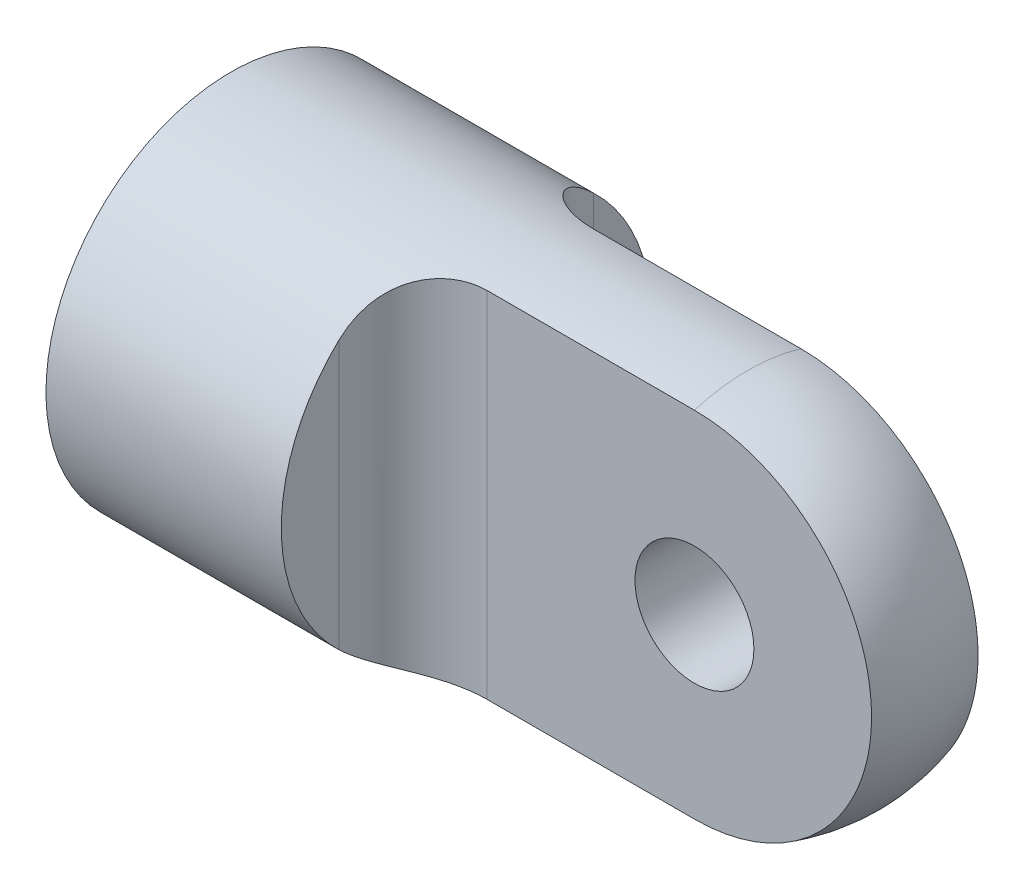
from build123d import *

# Parameters (mm, degrees)
CUT_EXTRUDE1_DEPTH                    = 127
F_10_CLEARANCE_HOLE1_D                = 5.1054
TAPPED_HOLE_FOR_10_32_HELICOIL1_D     = 5.1054
TAPPED_HOLE_FOR_10_32_HELICOIL1_DEPTH = 9.525
TAPPED_HOLE_FOR_10_32_HELICOIL1_TIP   = 1.533816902


with BuildPart() as part:
    # Sketch1 → Revolve1 (revolve)
    with BuildSketch(Plane.XY, mode=Mode.PRIVATE) as revolve1_sk:
        with BuildLine():
            Line((-15.0622, 0), (15.0622, 0))
            ThreePointArc((15.0622, 0), (12.737360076, 5.612660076), (7.1247, 7.9375))
            Line((7.1247, 7.9375), (-15.0622, 7.9375))
            Line((-15.0622, 7.9375), (-15.0622, 0))
        make_face()
    revolve(revolve1_sk.sketch.rotate(Axis((-15.0622, 0, 0), (1, 0, 0)), 180), axis=Axis((-15.0622, 0, 0), (1, 0, 0)))

    # Sketch2 → Cut-Extrude1 (cut, symmetric)
    with BuildSketch(Plane(origin=(0, 0, 0), x_dir=(1, 0, 0), z_dir=(0, 1, 0))):
        with BuildLine():
            Line((7.1247, 7.9375), (-4.95910863, 7.9375))
            Line((-4.95910863, 7.9375), (-4.95910863, 5.461))
            ThreePointArc((-4.95910863, 5.461), (-4.02917266, 3.21593597), (-1.78410863, 2.286))
            Line((-1.78410863, 2.286), (14.72589137, 2.286))
            ThreePointArc((14.72589137, 2.286), (11.86066776, 6.369812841), (7.1247, 7.9375))
        make_face()
        with BuildLine():
            Line((-4.95910863, -7.9375), (7.1247, -7.9375))
            ThreePointArc((7.1247, -7.9375), (11.86066776, -6.369812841), (14.72589137, -2.286))
            Line((14.72589137, -2.286), (-1.78410863, -2.286))
            ThreePointArc((-1.78410863, -2.286), (-4.02917266, -3.21593597), (-4.95910863, -5.461))
            Line((-4.95910863, -5.461), (-4.95910863, -7.9375))
        make_face()
    extrude(amount=CUT_EXTRUDE1_DEPTH, both=True, mode=Mode.SUBTRACT)

    # 10 Clearance Hole1 (through all)
    with Locations(Plane(origin=(7.1247, 0, 2.286), x_dir=(1, 0, 0), z_dir=(0, 0, 1))):
        with Locations((0, 0)):
            Hole(F_10_CLEARANCE_HOLE1_D / 2)

    # Tapped Hole for _10-32 Helicoil1
    with Locations(Plane(origin=(-15.0622, 0, 0), x_dir=(0, -1, 0), z_dir=(-1, 0, 0))):
        with Locations((0, 0)):
            Hole(TAPPED_HOLE_FOR_10_32_HELICOIL1_D / 2, depth=TAPPED_HOLE_FOR_10_32_HELICOIL1_DEPTH)
            with Locations((0, 0, -(TAPPED_HOLE_FOR_10_32_HELICOIL1_DEPTH + TAPPED_HOLE_FOR_10_32_HELICOIL1_TIP / 2))):  # 118° drill point
                Cone(0, TAPPED_HOLE_FOR_10_32_HELICOIL1_D / 2, TAPPED_HOLE_FOR_10_32_HELICOIL1_TIP, mode=Mode.SUBTRACT)


solid = part.part
